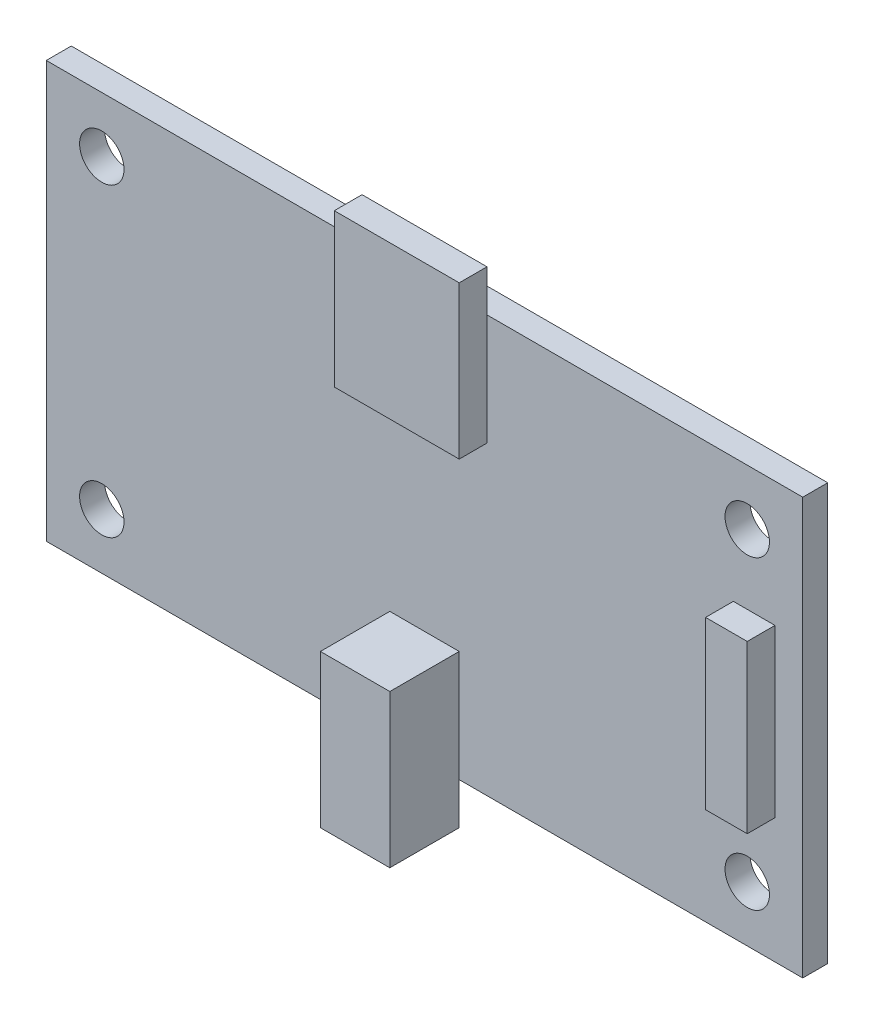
ISO-10303-21;
HEADER;
FILE_DESCRIPTION(('STEP AP214'),'2;1');
FILE_NAME('part.step','',(''),(''),'','','');
FILE_SCHEMA(('AUTOMOTIVE_DESIGN { 1 0 10303 214 1 1 1 1 }'));
ENDSEC;
DATA;
#1=APPLICATION_CONTEXT('core data for automotive mechanical design processes');
#2=APPLICATION_PROTOCOL_DEFINITION('international standard','automotive_design',2000,#1);
#3=PRODUCT_CONTEXT('',#1,'mechanical');
#4=PRODUCT('Part','Part','',(#3));
#5=PRODUCT_RELATED_PRODUCT_CATEGORY('part','',(#4));
#6=PRODUCT_DEFINITION_FORMATION('','',#4);
#7=PRODUCT_DEFINITION_CONTEXT('part definition',#1,'design');
#8=PRODUCT_DEFINITION('design','',#6,#7);
#9=PRODUCT_DEFINITION_SHAPE('','',#8);
#10=(LENGTH_UNIT() NAMED_UNIT(*) SI_UNIT(.MILLI.,.METRE.));
#11=(NAMED_UNIT(*) PLANE_ANGLE_UNIT() SI_UNIT($,.RADIAN.));
#12=(NAMED_UNIT(*) SI_UNIT($,.STERADIAN.) SOLID_ANGLE_UNIT());
#13=UNCERTAINTY_MEASURE_WITH_UNIT(LENGTH_MEASURE(1.E-05),#10,'distance_accuracy_value','');
#14=(GEOMETRIC_REPRESENTATION_CONTEXT(3) GLOBAL_UNCERTAINTY_ASSIGNED_CONTEXT((#13)) GLOBAL_UNIT_ASSIGNED_CONTEXT((#10,
#11,#12)) REPRESENTATION_CONTEXT('',''));
#15=CARTESIAN_POINT('',(0.,0.,0.));
#16=DIRECTION('',(0.,0.,1.));
#17=DIRECTION('',(1.,0.,0.));
#18=AXIS2_PLACEMENT_3D('',#15,#16,#17);
#19=CARTESIAN_POINT('',(0.,30.,1.8));
#20=DIRECTION('',(0.,0.,-1.));
#21=DIRECTION('',(-1.,0.,0.));
#22=AXIS2_PLACEMENT_3D('',#19,#20,#21);
#23=PLANE('',#22);
#24=CARTESIAN_POINT('',(4.,26.,1.8));
#25=DIRECTION('',(0.,0.,1.));
#26=DIRECTION('',(1.,0.,0.));
#27=AXIS2_PLACEMENT_3D('',#24,#25,#26);
#28=CIRCLE('',#27,1.6);
#29=CARTESIAN_POINT('',(5.6,26.,1.8));
#30=VERTEX_POINT('',#29);
#31=EDGE_CURVE('E576',#30,#30,#28,.T.);
#32=ORIENTED_EDGE('',*,*,#31,.F.);
#33=EDGE_LOOP('',(#32));
#34=FACE_BOUND('',#33,.T.);
#35=CARTESIAN_POINT('',(4.,4.,1.8));
#36=DIRECTION('',(0.,0.,1.));
#37=DIRECTION('',(1.,0.,0.));
#38=AXIS2_PLACEMENT_3D('',#35,#36,#37);
#39=CIRCLE('',#38,1.6);
#40=CARTESIAN_POINT('',(5.6,4.,1.8));
#41=VERTEX_POINT('',#40);
#42=EDGE_CURVE('E580',#41,#41,#39,.T.);
#43=ORIENTED_EDGE('',*,*,#42,.F.);
#44=EDGE_LOOP('',(#43));
#45=FACE_BOUND('',#44,.T.);
#46=CARTESIAN_POINT('',(50.5,4.,1.8));
#47=DIRECTION('',(0.,0.,1.));
#48=DIRECTION('',(1.,0.,0.));
#49=AXIS2_PLACEMENT_3D('',#46,#47,#48);
#50=CIRCLE('',#49,1.6);
#51=CARTESIAN_POINT('',(52.1,4.,1.8));
#52=VERTEX_POINT('',#51);
#53=EDGE_CURVE('E587',#52,#52,#50,.T.);
#54=ORIENTED_EDGE('',*,*,#53,.F.);
#55=EDGE_LOOP('',(#54));
#56=FACE_BOUND('',#55,.T.);
#57=CARTESIAN_POINT('',(50.5,26.,1.8));
#58=DIRECTION('',(0.,0.,1.));
#59=DIRECTION('',(1.,0.,0.));
#60=AXIS2_PLACEMENT_3D('',#57,#58,#59);
#61=CIRCLE('',#60,1.6);
#62=CARTESIAN_POINT('',(52.1,26.,1.8));
#63=VERTEX_POINT('',#62);
#64=EDGE_CURVE('E593',#63,#63,#61,.T.);
#65=ORIENTED_EDGE('',*,*,#64,.F.);
#66=EDGE_LOOP('',(#65));
#67=FACE_BOUND('',#66,.T.);
#68=DIRECTION('',(0.,-1.,0.));
#69=VECTOR('',#68,1.);
#70=CARTESIAN_POINT('',(22.75,33.,1.8));
#71=LINE('',#70,#69);
#72=CARTESIAN_POINT('',(22.75,30.,1.8));
#73=VERTEX_POINT('',#72);
#74=CARTESIAN_POINT('',(22.75,22.,1.8));
#75=VERTEX_POINT('',#74);
#76=EDGE_CURVE('E182',#73,#75,#71,.T.);
#77=ORIENTED_EDGE('',*,*,#76,.F.);
#78=DIRECTION('',(-1.,0.,0.));
#79=VECTOR('',#78,1.);
#80=CARTESIAN_POINT('',(0.,30.,1.8));
#81=LINE('',#80,#79);
#82=CARTESIAN_POINT('',(0.,30.,1.8));
#83=VERTEX_POINT('',#82);
#84=EDGE_CURVE('E265',#73,#83,#81,.T.);
#85=ORIENTED_EDGE('',*,*,#84,.T.);
#86=DIRECTION('',(0.,-1.,0.));
#87=VECTOR('',#86,1.);
#88=CARTESIAN_POINT('',(0.,0.,1.8));
#89=LINE('',#88,#87);
#90=CARTESIAN_POINT('',(0.,0.,1.8));
#91=VERTEX_POINT('',#90);
#92=EDGE_CURVE('E254',#83,#91,#89,.T.);
#93=ORIENTED_EDGE('',*,*,#92,.T.);
#94=DIRECTION('',(1.,0.,0.));
#95=VECTOR('',#94,1.);
#96=CARTESIAN_POINT('',(0.,0.,1.8));
#97=LINE('',#96,#95);
#98=CARTESIAN_POINT('',(24.75,0.,1.8));
#99=VERTEX_POINT('',#98);
#100=EDGE_CURVE('E259',#91,#99,#97,.T.);
#101=ORIENTED_EDGE('',*,*,#100,.T.);
#102=DIRECTION('',(0.,-1.,0.));
#103=VECTOR('',#102,1.);
#104=CARTESIAN_POINT('',(24.75,8.,1.8));
#105=LINE('',#104,#103);
#106=CARTESIAN_POINT('',(24.75,8.,1.8));
#107=VERTEX_POINT('',#106);
#108=EDGE_CURVE('E234',#107,#99,#105,.T.);
#109=ORIENTED_EDGE('',*,*,#108,.F.);
#110=DIRECTION('',(-1.,0.,0.));
#111=VECTOR('',#110,1.);
#112=CARTESIAN_POINT('',(24.75,8.,1.8));
#113=LINE('',#112,#111);
#114=CARTESIAN_POINT('',(29.75,8.,1.8));
#115=VERTEX_POINT('',#114);
#116=EDGE_CURVE('E227',#115,#107,#113,.T.);
#117=ORIENTED_EDGE('',*,*,#116,.F.);
#118=DIRECTION('',(0.,1.,0.));
#119=VECTOR('',#118,1.);
#120=CARTESIAN_POINT('',(29.75,8.,1.8));
#121=LINE('',#120,#119);
#122=CARTESIAN_POINT('',(29.75,0.,1.8));
#123=VERTEX_POINT('',#122);
#124=EDGE_CURVE('E11',#123,#115,#121,.T.);
#125=ORIENTED_EDGE('',*,*,#124,.F.);
#126=CARTESIAN_POINT('',(54.5,0.,1.8));
#127=VERTEX_POINT('',#126);
#128=EDGE_CURVE('E257',#123,#127,#97,.T.);
#129=ORIENTED_EDGE('',*,*,#128,.T.);
#130=DIRECTION('',(0.,1.,0.));
#131=VECTOR('',#130,1.);
#132=CARTESIAN_POINT('',(54.5,0.,1.8));
#133=LINE('',#132,#131);
#134=CARTESIAN_POINT('',(54.5,30.,1.8));
#135=VERTEX_POINT('',#134);
#136=EDGE_CURVE('E262',#127,#135,#133,.T.);
#137=ORIENTED_EDGE('',*,*,#136,.T.);
#138=CARTESIAN_POINT('',(31.75,30.,1.8));
#139=VERTEX_POINT('',#138);
#140=EDGE_CURVE('E266',#135,#139,#81,.T.);
#141=ORIENTED_EDGE('',*,*,#140,.T.);
#142=DIRECTION('',(0.,1.,0.));
#143=VECTOR('',#142,1.);
#144=CARTESIAN_POINT('',(31.75,33.,1.8));
#145=LINE('',#144,#143);
#146=CARTESIAN_POINT('',(31.75,22.,1.8));
#147=VERTEX_POINT('',#146);
#148=EDGE_CURVE('E207',#147,#139,#145,.T.);
#149=ORIENTED_EDGE('',*,*,#148,.F.);
#150=DIRECTION('',(1.,0.,0.));
#151=VECTOR('',#150,1.);
#152=CARTESIAN_POINT('',(22.75,22.,1.8));
#153=LINE('',#152,#151);
#154=EDGE_CURVE('E203',#75,#147,#153,.T.);
#155=ORIENTED_EDGE('',*,*,#154,.F.);
#156=EDGE_LOOP('',(#77,#85,#93,#101,#109,#117,#125,#129,#137,#141,#149,#155));
#157=FACE_BOUND('',#156,.T.);
#158=DIRECTION('',(0.,-1.,0.));
#159=VECTOR('',#158,1.);
#160=CARTESIAN_POINT('',(49.5,21.,1.8));
#161=LINE('',#160,#159);
#162=CARTESIAN_POINT('',(49.5,21.,1.8));
#163=VERTEX_POINT('',#162);
#164=CARTESIAN_POINT('',(49.5,9.,1.8));
#165=VERTEX_POINT('',#164);
#166=EDGE_CURVE('E181',#163,#165,#161,.T.);
#167=ORIENTED_EDGE('',*,*,#166,.F.);
#168=DIRECTION('',(-1.,0.,0.));
#169=VECTOR('',#168,1.);
#170=CARTESIAN_POINT('',(49.5,21.,1.8));
#171=LINE('',#170,#169);
#172=CARTESIAN_POINT('',(52.5,21.,1.8));
#173=VERTEX_POINT('',#172);
#174=EDGE_CURVE('E178',#173,#163,#171,.T.);
#175=ORIENTED_EDGE('',*,*,#174,.F.);
#176=DIRECTION('',(0.,1.,0.));
#177=VECTOR('',#176,1.);
#178=CARTESIAN_POINT('',(52.5,21.,1.8));
#179=LINE('',#178,#177);
#180=CARTESIAN_POINT('',(52.5,9.,1.8));
#181=VERTEX_POINT('',#180);
#182=EDGE_CURVE('E56',#181,#173,#179,.T.);
#183=ORIENTED_EDGE('',*,*,#182,.F.);
#184=DIRECTION('',(1.,0.,0.));
#185=VECTOR('',#184,1.);
#186=CARTESIAN_POINT('',(49.5,9.,1.8));
#187=LINE('',#186,#185);
#188=EDGE_CURVE('E51',#165,#181,#187,.T.);
#189=ORIENTED_EDGE('',*,*,#188,.F.);
#190=EDGE_LOOP('',(#167,#175,#183,#189));
#191=FACE_BOUND('',#190,.T.);
#192=ADVANCED_FACE('F34',(#34,#45,#56,#67,#157,#191),#23,.F.);
#193=CARTESIAN_POINT('',(0.,0.,1.8));
#194=DIRECTION('',(1.,0.,0.));
#195=DIRECTION('',(0.,0.,-1.));
#196=AXIS2_PLACEMENT_3D('',#193,#194,#195);
#197=PLANE('',#196);
#198=DIRECTION('',(0.,-1.,0.));
#199=VECTOR('',#198,1.);
#200=CARTESIAN_POINT('',(0.,0.,0.));
#201=LINE('',#200,#199);
#202=CARTESIAN_POINT('',(0.,30.,0.));
#203=VERTEX_POINT('',#202);
#204=CARTESIAN_POINT('',(0.,0.,0.));
#205=VERTEX_POINT('',#204);
#206=EDGE_CURVE('E253',#203,#205,#201,.T.);
#207=ORIENTED_EDGE('',*,*,#206,.T.);
#208=DIRECTION('',(0.,0.,-1.));
#209=VECTOR('',#208,1.);
#210=CARTESIAN_POINT('',(0.,0.,1.8));
#211=LINE('',#210,#209);
#212=EDGE_CURVE('E38',#91,#205,#211,.T.);
#213=ORIENTED_EDGE('',*,*,#212,.F.);
#214=ORIENTED_EDGE('',*,*,#92,.F.);
#215=DIRECTION('',(0.,0.,-1.));
#216=VECTOR('',#215,1.);
#217=CARTESIAN_POINT('',(0.,30.,1.8));
#218=LINE('',#217,#216);
#219=EDGE_CURVE('E269',#83,#203,#218,.T.);
#220=ORIENTED_EDGE('',*,*,#219,.T.);
#221=EDGE_LOOP('',(#207,#213,#214,#220));
#222=FACE_BOUND('',#221,.T.);
#223=ADVANCED_FACE('F36',(#222),#197,.F.);
#224=CARTESIAN_POINT('',(0.,0.,1.8));
#225=DIRECTION('',(0.,1.,0.));
#226=DIRECTION('',(0.,0.,1.));
#227=AXIS2_PLACEMENT_3D('',#224,#225,#226);
#228=PLANE('',#227);
#229=DIRECTION('',(1.,0.,0.));
#230=VECTOR('',#229,1.);
#231=CARTESIAN_POINT('',(0.,0.,0.));
#232=LINE('',#231,#230);
#233=CARTESIAN_POINT('',(54.5,0.,0.));
#234=VERTEX_POINT('',#233);
#235=EDGE_CURVE('E273',#205,#234,#232,.T.);
#236=ORIENTED_EDGE('',*,*,#235,.T.);
#237=DIRECTION('',(0.,0.,-1.));
#238=VECTOR('',#237,1.);
#239=CARTESIAN_POINT('',(54.5,0.,1.8));
#240=LINE('',#239,#238);
#241=EDGE_CURVE('E282',#127,#234,#240,.T.);
#242=ORIENTED_EDGE('',*,*,#241,.F.);
#243=ORIENTED_EDGE('',*,*,#128,.F.);
#244=EDGE_CURVE('E263',#99,#123,#97,.T.);
#245=ORIENTED_EDGE('',*,*,#244,.F.);
#246=ORIENTED_EDGE('',*,*,#100,.F.);
#247=ORIENTED_EDGE('',*,*,#212,.T.);
#248=EDGE_LOOP('',(#236,#242,#243,#245,#246,#247));
#249=FACE_BOUND('',#248,.T.);
#250=ADVANCED_FACE('F291',(#249),#228,.F.);
#251=CARTESIAN_POINT('',(54.5,0.,1.8));
#252=DIRECTION('',(-1.,0.,0.));
#253=DIRECTION('',(0.,-1.,0.));
#254=AXIS2_PLACEMENT_3D('',#251,#252,#253);
#255=PLANE('',#254);
#256=DIRECTION('',(0.,1.,0.));
#257=VECTOR('',#256,1.);
#258=CARTESIAN_POINT('',(54.5,0.,0.));
#259=LINE('',#258,#257);
#260=CARTESIAN_POINT('',(54.5,30.,0.));
#261=VERTEX_POINT('',#260);
#262=EDGE_CURVE('E275',#234,#261,#259,.T.);
#263=ORIENTED_EDGE('',*,*,#262,.T.);
#264=DIRECTION('',(0.,0.,-1.));
#265=VECTOR('',#264,1.);
#266=CARTESIAN_POINT('',(54.5,30.,1.8));
#267=LINE('',#266,#265);
#268=EDGE_CURVE('E280',#135,#261,#267,.T.);
#269=ORIENTED_EDGE('',*,*,#268,.F.);
#270=ORIENTED_EDGE('',*,*,#136,.F.);
#271=ORIENTED_EDGE('',*,*,#241,.T.);
#272=EDGE_LOOP('',(#263,#269,#270,#271));
#273=FACE_BOUND('',#272,.T.);
#274=ADVANCED_FACE('F300',(#273),#255,.F.);
#275=CARTESIAN_POINT('',(0.,30.,1.8));
#276=DIRECTION('',(0.,-1.,0.));
#277=DIRECTION('',(0.,0.,-1.));
#278=AXIS2_PLACEMENT_3D('',#275,#276,#277);
#279=PLANE('',#278);
#280=DIRECTION('',(-1.,0.,0.));
#281=VECTOR('',#280,1.);
#282=CARTESIAN_POINT('',(0.,30.,0.));
#283=LINE('',#282,#281);
#284=EDGE_CURVE('E258',#261,#203,#283,.T.);
#285=ORIENTED_EDGE('',*,*,#284,.T.);
#286=ORIENTED_EDGE('',*,*,#219,.F.);
#287=ORIENTED_EDGE('',*,*,#84,.F.);
#288=EDGE_CURVE('E270',#139,#73,#81,.T.);
#289=ORIENTED_EDGE('',*,*,#288,.F.);
#290=ORIENTED_EDGE('',*,*,#140,.F.);
#291=ORIENTED_EDGE('',*,*,#268,.T.);
#292=EDGE_LOOP('',(#285,#286,#287,#289,#290,#291));
#293=FACE_BOUND('',#292,.T.);
#294=ADVANCED_FACE('F303',(#293),#279,.F.);
#295=CARTESIAN_POINT('',(0.,30.,0.));
#296=DIRECTION('',(0.,0.,-1.));
#297=DIRECTION('',(-1.,0.,0.));
#298=AXIS2_PLACEMENT_3D('',#295,#296,#297);
#299=PLANE('',#298);
#300=CARTESIAN_POINT('',(4.,26.,0.));
#301=DIRECTION('',(0.,0.,-1.));
#302=DIRECTION('',(-1.,0.,0.));
#303=AXIS2_PLACEMENT_3D('',#300,#301,#302);
#304=CIRCLE('',#303,1.6);
#305=CARTESIAN_POINT('',(2.4,26.,0.));
#306=VERTEX_POINT('',#305);
#307=EDGE_CURVE('E574',#306,#306,#304,.F.);
#308=ORIENTED_EDGE('',*,*,#307,.T.);
#309=EDGE_LOOP('',(#308));
#310=FACE_BOUND('',#309,.T.);
#311=CARTESIAN_POINT('',(4.,4.,0.));
#312=DIRECTION('',(0.,0.,-1.));
#313=DIRECTION('',(-1.,0.,0.));
#314=AXIS2_PLACEMENT_3D('',#311,#312,#313);
#315=CIRCLE('',#314,1.6);
#316=CARTESIAN_POINT('',(2.4,4.,0.));
#317=VERTEX_POINT('',#316);
#318=EDGE_CURVE('E577',#317,#317,#315,.F.);
#319=ORIENTED_EDGE('',*,*,#318,.T.);
#320=EDGE_LOOP('',(#319));
#321=FACE_BOUND('',#320,.T.);
#322=CARTESIAN_POINT('',(50.5,4.,0.));
#323=DIRECTION('',(0.,0.,-1.));
#324=DIRECTION('',(-1.,0.,0.));
#325=AXIS2_PLACEMENT_3D('',#322,#323,#324);
#326=CIRCLE('',#325,1.6);
#327=CARTESIAN_POINT('',(48.9,4.,0.));
#328=VERTEX_POINT('',#327);
#329=EDGE_CURVE('E585',#328,#328,#326,.F.);
#330=ORIENTED_EDGE('',*,*,#329,.T.);
#331=EDGE_LOOP('',(#330));
#332=FACE_BOUND('',#331,.T.);
#333=CARTESIAN_POINT('',(50.5,26.,0.));
#334=DIRECTION('',(0.,0.,-1.));
#335=DIRECTION('',(-1.,0.,0.));
#336=AXIS2_PLACEMENT_3D('',#333,#334,#335);
#337=CIRCLE('',#336,1.6);
#338=CARTESIAN_POINT('',(48.9,26.,0.));
#339=VERTEX_POINT('',#338);
#340=EDGE_CURVE('E590',#339,#339,#337,.F.);
#341=ORIENTED_EDGE('',*,*,#340,.T.);
#342=EDGE_LOOP('',(#341));
#343=FACE_BOUND('',#342,.T.);
#344=ORIENTED_EDGE('',*,*,#206,.F.);
#345=ORIENTED_EDGE('',*,*,#284,.F.);
#346=ORIENTED_EDGE('',*,*,#262,.F.);
#347=ORIENTED_EDGE('',*,*,#235,.F.);
#348=EDGE_LOOP('',(#344,#345,#346,#347));
#349=FACE_BOUND('',#348,.T.);
#350=ADVANCED_FACE('F298',(#310,#321,#332,#343,#349),#299,.T.);
#351=CARTESIAN_POINT('',(24.75,-3.,1.8));
#352=DIRECTION('',(0.,0.,1.));
#353=DIRECTION('',(1.,0.,0.));
#354=AXIS2_PLACEMENT_3D('',#351,#352,#353);
#355=PLANE('',#354);
#356=CARTESIAN_POINT('',(24.75,-3.,1.8));
#357=VERTEX_POINT('',#356);
#358=EDGE_CURVE('E222',#99,#357,#105,.T.);
#359=ORIENTED_EDGE('',*,*,#358,.F.);
#360=ORIENTED_EDGE('',*,*,#244,.T.);
#361=CARTESIAN_POINT('',(29.75,-3.,1.8));
#362=VERTEX_POINT('',#361);
#363=EDGE_CURVE('E44',#362,#123,#121,.T.);
#364=ORIENTED_EDGE('',*,*,#363,.F.);
#365=DIRECTION('',(1.,0.,0.));
#366=VECTOR('',#365,1.);
#367=CARTESIAN_POINT('',(24.75,-3.,1.8));
#368=LINE('',#367,#366);
#369=EDGE_CURVE('E237',#357,#362,#368,.T.);
#370=ORIENTED_EDGE('',*,*,#369,.F.);
#371=EDGE_LOOP('',(#359,#360,#364,#370));
#372=FACE_BOUND('',#371,.T.);
#373=ADVANCED_FACE('F352',(#372),#355,.F.);
#374=CARTESIAN_POINT('',(24.75,8.,6.8));
#375=DIRECTION('',(1.,0.,0.));
#376=DIRECTION('',(0.,1.,0.));
#377=AXIS2_PLACEMENT_3D('',#374,#375,#376);
#378=PLANE('',#377);
#379=ORIENTED_EDGE('',*,*,#108,.T.);
#380=ORIENTED_EDGE('',*,*,#358,.T.);
#381=DIRECTION('',(0.,0.,-1.));
#382=VECTOR('',#381,1.);
#383=CARTESIAN_POINT('',(24.75,-3.,6.8));
#384=LINE('',#383,#382);
#385=CARTESIAN_POINT('',(24.75,-3.,6.8));
#386=VERTEX_POINT('',#385);
#387=EDGE_CURVE('E250',#386,#357,#384,.T.);
#388=ORIENTED_EDGE('',*,*,#387,.F.);
#389=DIRECTION('',(0.,-1.,0.));
#390=VECTOR('',#389,1.);
#391=CARTESIAN_POINT('',(24.75,8.,6.8));
#392=LINE('',#391,#390);
#393=CARTESIAN_POINT('',(24.75,8.,6.8));
#394=VERTEX_POINT('',#393);
#395=EDGE_CURVE('E223',#394,#386,#392,.T.);
#396=ORIENTED_EDGE('',*,*,#395,.F.);
#397=DIRECTION('',(0.,0.,-1.));
#398=VECTOR('',#397,1.);
#399=CARTESIAN_POINT('',(24.75,8.,6.8));
#400=LINE('',#399,#398);
#401=EDGE_CURVE('E233',#394,#107,#400,.T.);
#402=ORIENTED_EDGE('',*,*,#401,.T.);
#403=EDGE_LOOP('',(#379,#380,#388,#396,#402));
#404=FACE_BOUND('',#403,.T.);
#405=ADVANCED_FACE('F348',(#404),#378,.F.);
#406=CARTESIAN_POINT('',(24.75,-3.,6.8));
#407=DIRECTION('',(0.,1.,0.));
#408=DIRECTION('',(-1.,0.,0.));
#409=AXIS2_PLACEMENT_3D('',#406,#407,#408);
#410=PLANE('',#409);
#411=ORIENTED_EDGE('',*,*,#369,.T.);
#412=DIRECTION('',(0.,0.,-1.));
#413=VECTOR('',#412,1.);
#414=CARTESIAN_POINT('',(29.75,-3.,6.8));
#415=LINE('',#414,#413);
#416=CARTESIAN_POINT('',(29.75,-3.,6.8));
#417=VERTEX_POINT('',#416);
#418=EDGE_CURVE('E247',#417,#362,#415,.T.);
#419=ORIENTED_EDGE('',*,*,#418,.F.);
#420=DIRECTION('',(1.,0.,0.));
#421=VECTOR('',#420,1.);
#422=CARTESIAN_POINT('',(24.75,-3.,6.8));
#423=LINE('',#422,#421);
#424=EDGE_CURVE('E226',#386,#417,#423,.T.);
#425=ORIENTED_EDGE('',*,*,#424,.F.);
#426=ORIENTED_EDGE('',*,*,#387,.T.);
#427=EDGE_LOOP('',(#411,#419,#425,#426));
#428=FACE_BOUND('',#427,.T.);
#429=ADVANCED_FACE('F390',(#428),#410,.F.);
#430=CARTESIAN_POINT('',(29.75,8.,6.8));
#431=DIRECTION('',(-1.,0.,0.));
#432=DIRECTION('',(0.,-1.,0.));
#433=AXIS2_PLACEMENT_3D('',#430,#431,#432);
#434=PLANE('',#433);
#435=ORIENTED_EDGE('',*,*,#363,.T.);
#436=ORIENTED_EDGE('',*,*,#124,.T.);
#437=DIRECTION('',(0.,0.,-1.));
#438=VECTOR('',#437,1.);
#439=CARTESIAN_POINT('',(29.75,8.,6.8));
#440=LINE('',#439,#438);
#441=CARTESIAN_POINT('',(29.75,8.,6.8));
#442=VERTEX_POINT('',#441);
#443=EDGE_CURVE('E244',#442,#115,#440,.T.);
#444=ORIENTED_EDGE('',*,*,#443,.F.);
#445=DIRECTION('',(0.,1.,0.));
#446=VECTOR('',#445,1.);
#447=CARTESIAN_POINT('',(29.75,8.,6.8));
#448=LINE('',#447,#446);
#449=EDGE_CURVE('E229',#417,#442,#448,.T.);
#450=ORIENTED_EDGE('',*,*,#449,.F.);
#451=ORIENTED_EDGE('',*,*,#418,.T.);
#452=EDGE_LOOP('',(#435,#436,#444,#450,#451));
#453=FACE_BOUND('',#452,.T.);
#454=ADVANCED_FACE('F397',(#453),#434,.F.);
#455=CARTESIAN_POINT('',(24.75,8.,6.8));
#456=DIRECTION('',(0.,-1.,0.));
#457=DIRECTION('',(0.,0.,-1.));
#458=AXIS2_PLACEMENT_3D('',#455,#456,#457);
#459=PLANE('',#458);
#460=ORIENTED_EDGE('',*,*,#116,.T.);
#461=ORIENTED_EDGE('',*,*,#401,.F.);
#462=DIRECTION('',(-1.,0.,0.));
#463=VECTOR('',#462,1.);
#464=CARTESIAN_POINT('',(24.75,8.,6.8));
#465=LINE('',#464,#463);
#466=EDGE_CURVE('E231',#442,#394,#465,.T.);
#467=ORIENTED_EDGE('',*,*,#466,.F.);
#468=ORIENTED_EDGE('',*,*,#443,.T.);
#469=EDGE_LOOP('',(#460,#461,#467,#468));
#470=FACE_BOUND('',#469,.T.);
#471=ADVANCED_FACE('F404',(#470),#459,.F.);
#472=CARTESIAN_POINT('',(24.75,-3.,6.8));
#473=DIRECTION('',(0.,0.,1.));
#474=DIRECTION('',(1.,0.,0.));
#475=AXIS2_PLACEMENT_3D('',#472,#473,#474);
#476=PLANE('',#475);
#477=ORIENTED_EDGE('',*,*,#395,.T.);
#478=ORIENTED_EDGE('',*,*,#424,.T.);
#479=ORIENTED_EDGE('',*,*,#449,.T.);
#480=ORIENTED_EDGE('',*,*,#466,.T.);
#481=EDGE_LOOP('',(#477,#478,#479,#480));
#482=FACE_BOUND('',#481,.T.);
#483=ADVANCED_FACE('F412',(#482),#476,.T.);
#484=CARTESIAN_POINT('',(22.75,22.,1.8));
#485=DIRECTION('',(0.,0.,1.));
#486=DIRECTION('',(1.,0.,0.));
#487=AXIS2_PLACEMENT_3D('',#484,#485,#486);
#488=PLANE('',#487);
#489=CARTESIAN_POINT('',(31.75,33.,1.8));
#490=VERTEX_POINT('',#489);
#491=EDGE_CURVE('E206',#139,#490,#145,.T.);
#492=ORIENTED_EDGE('',*,*,#491,.F.);
#493=ORIENTED_EDGE('',*,*,#288,.T.);
#494=CARTESIAN_POINT('',(22.75,33.,1.8));
#495=VERTEX_POINT('',#494);
#496=EDGE_CURVE('E185',#495,#73,#71,.T.);
#497=ORIENTED_EDGE('',*,*,#496,.F.);
#498=DIRECTION('',(-1.,0.,0.));
#499=VECTOR('',#498,1.);
#500=CARTESIAN_POINT('',(22.75,33.,1.8));
#501=LINE('',#500,#499);
#502=EDGE_CURVE('E195',#490,#495,#501,.T.);
#503=ORIENTED_EDGE('',*,*,#502,.F.);
#504=EDGE_LOOP('',(#492,#493,#497,#503));
#505=FACE_BOUND('',#504,.T.);
#506=ADVANCED_FACE('F310',(#505),#488,.F.);
#507=CARTESIAN_POINT('',(22.75,33.,3.8));
#508=DIRECTION('',(1.,0.,0.));
#509=DIRECTION('',(0.,1.,0.));
#510=AXIS2_PLACEMENT_3D('',#507,#508,#509);
#511=PLANE('',#510);
#512=ORIENTED_EDGE('',*,*,#496,.T.);
#513=ORIENTED_EDGE('',*,*,#76,.T.);
#514=DIRECTION('',(0.,0.,-1.));
#515=VECTOR('',#514,1.);
#516=CARTESIAN_POINT('',(22.75,22.,3.8));
#517=LINE('',#516,#515);
#518=CARTESIAN_POINT('',(22.75,22.,3.8));
#519=VERTEX_POINT('',#518);
#520=EDGE_CURVE('E219',#519,#75,#517,.T.);
#521=ORIENTED_EDGE('',*,*,#520,.F.);
#522=DIRECTION('',(0.,-1.,0.));
#523=VECTOR('',#522,1.);
#524=CARTESIAN_POINT('',(22.75,33.,3.8));
#525=LINE('',#524,#523);
#526=CARTESIAN_POINT('',(22.75,33.,3.8));
#527=VERTEX_POINT('',#526);
#528=EDGE_CURVE('E191',#527,#519,#525,.T.);
#529=ORIENTED_EDGE('',*,*,#528,.F.);
#530=DIRECTION('',(0.,0.,-1.));
#531=VECTOR('',#530,1.);
#532=CARTESIAN_POINT('',(22.75,33.,3.8));
#533=LINE('',#532,#531);
#534=EDGE_CURVE('E200',#527,#495,#533,.T.);
#535=ORIENTED_EDGE('',*,*,#534,.T.);
#536=EDGE_LOOP('',(#512,#513,#521,#529,#535));
#537=FACE_BOUND('',#536,.T.);
#538=ADVANCED_FACE('F321',(#537),#511,.F.);
#539=CARTESIAN_POINT('',(22.75,22.,3.8));
#540=DIRECTION('',(0.,1.,0.));
#541=DIRECTION('',(-1.,0.,0.));
#542=AXIS2_PLACEMENT_3D('',#539,#540,#541);
#543=PLANE('',#542);
#544=ORIENTED_EDGE('',*,*,#154,.T.);
#545=DIRECTION('',(0.,0.,-1.));
#546=VECTOR('',#545,1.);
#547=CARTESIAN_POINT('',(31.75,22.,3.8));
#548=LINE('',#547,#546);
#549=CARTESIAN_POINT('',(31.75,22.,3.8));
#550=VERTEX_POINT('',#549);
#551=EDGE_CURVE('E216',#550,#147,#548,.T.);
#552=ORIENTED_EDGE('',*,*,#551,.F.);
#553=DIRECTION('',(1.,0.,0.));
#554=VECTOR('',#553,1.);
#555=CARTESIAN_POINT('',(22.75,22.,3.8));
#556=LINE('',#555,#554);
#557=EDGE_CURVE('E194',#519,#550,#556,.T.);
#558=ORIENTED_EDGE('',*,*,#557,.F.);
#559=ORIENTED_EDGE('',*,*,#520,.T.);
#560=EDGE_LOOP('',(#544,#552,#558,#559));
#561=FACE_BOUND('',#560,.T.);
#562=ADVANCED_FACE('F318',(#561),#543,.F.);
#563=CARTESIAN_POINT('',(31.75,33.,3.8));
#564=DIRECTION('',(-1.,0.,0.));
#565=DIRECTION('',(0.,-1.,0.));
#566=AXIS2_PLACEMENT_3D('',#563,#564,#565);
#567=PLANE('',#566);
#568=ORIENTED_EDGE('',*,*,#148,.T.);
#569=ORIENTED_EDGE('',*,*,#491,.T.);
#570=DIRECTION('',(0.,0.,-1.));
#571=VECTOR('',#570,1.);
#572=CARTESIAN_POINT('',(31.75,33.,3.8));
#573=LINE('',#572,#571);
#574=CARTESIAN_POINT('',(31.75,33.,3.8));
#575=VERTEX_POINT('',#574);
#576=EDGE_CURVE('E213',#575,#490,#573,.T.);
#577=ORIENTED_EDGE('',*,*,#576,.F.);
#578=DIRECTION('',(0.,1.,0.));
#579=VECTOR('',#578,1.);
#580=CARTESIAN_POINT('',(31.75,33.,3.8));
#581=LINE('',#580,#579);
#582=EDGE_CURVE('E197',#550,#575,#581,.T.);
#583=ORIENTED_EDGE('',*,*,#582,.F.);
#584=ORIENTED_EDGE('',*,*,#551,.T.);
#585=EDGE_LOOP('',(#568,#569,#577,#583,#584));
#586=FACE_BOUND('',#585,.T.);
#587=ADVANCED_FACE('F314',(#586),#567,.F.);
#588=CARTESIAN_POINT('',(22.75,33.,3.8));
#589=DIRECTION('',(0.,-1.,0.));
#590=DIRECTION('',(0.,0.,-1.));
#591=AXIS2_PLACEMENT_3D('',#588,#589,#590);
#592=PLANE('',#591);
#593=ORIENTED_EDGE('',*,*,#502,.T.);
#594=ORIENTED_EDGE('',*,*,#534,.F.);
#595=DIRECTION('',(-1.,0.,0.));
#596=VECTOR('',#595,1.);
#597=CARTESIAN_POINT('',(22.75,33.,3.8));
#598=LINE('',#597,#596);
#599=EDGE_CURVE('E199',#575,#527,#598,.T.);
#600=ORIENTED_EDGE('',*,*,#599,.F.);
#601=ORIENTED_EDGE('',*,*,#576,.T.);
#602=EDGE_LOOP('',(#593,#594,#600,#601));
#603=FACE_BOUND('',#602,.T.);
#604=ADVANCED_FACE('F326',(#603),#592,.F.);
#605=CARTESIAN_POINT('',(22.75,22.,3.8));
#606=DIRECTION('',(0.,0.,1.));
#607=DIRECTION('',(1.,0.,0.));
#608=AXIS2_PLACEMENT_3D('',#605,#606,#607);
#609=PLANE('',#608);
#610=ORIENTED_EDGE('',*,*,#528,.T.);
#611=ORIENTED_EDGE('',*,*,#557,.T.);
#612=ORIENTED_EDGE('',*,*,#582,.T.);
#613=ORIENTED_EDGE('',*,*,#599,.T.);
#614=EDGE_LOOP('',(#610,#611,#612,#613));
#615=FACE_BOUND('',#614,.T.);
#616=ADVANCED_FACE('F328',(#615),#609,.T.);
#617=CARTESIAN_POINT('',(49.5,21.,3.8));
#618=DIRECTION('',(1.,0.,0.));
#619=DIRECTION('',(0.,0.,-1.));
#620=AXIS2_PLACEMENT_3D('',#617,#618,#619);
#621=PLANE('',#620);
#622=ORIENTED_EDGE('',*,*,#166,.T.);
#623=DIRECTION('',(0.,0.,-1.));
#624=VECTOR('',#623,1.);
#625=CARTESIAN_POINT('',(49.5,9.,3.8));
#626=LINE('',#625,#624);
#627=CARTESIAN_POINT('',(49.5,9.,3.8));
#628=VERTEX_POINT('',#627);
#629=EDGE_CURVE('E162',#628,#165,#626,.T.);
#630=ORIENTED_EDGE('',*,*,#629,.F.);
#631=DIRECTION('',(0.,-1.,0.));
#632=VECTOR('',#631,1.);
#633=CARTESIAN_POINT('',(49.5,21.,3.8));
#634=LINE('',#633,#632);
#635=CARTESIAN_POINT('',(49.5,21.,3.8));
#636=VERTEX_POINT('',#635);
#637=EDGE_CURVE('E169',#636,#628,#634,.T.);
#638=ORIENTED_EDGE('',*,*,#637,.F.);
#639=DIRECTION('',(0.,0.,-1.));
#640=VECTOR('',#639,1.);
#641=CARTESIAN_POINT('',(49.5,21.,3.8));
#642=LINE('',#641,#640);
#643=EDGE_CURVE('E600',#636,#163,#642,.T.);
#644=ORIENTED_EDGE('',*,*,#643,.T.);
#645=EDGE_LOOP('',(#622,#630,#638,#644));
#646=FACE_BOUND('',#645,.T.);
#647=ADVANCED_FACE('F180',(#646),#621,.F.);
#648=CARTESIAN_POINT('',(49.5,9.,3.8));
#649=DIRECTION('',(0.,1.,0.));
#650=DIRECTION('',(-1.,0.,0.));
#651=AXIS2_PLACEMENT_3D('',#648,#649,#650);
#652=PLANE('',#651);
#653=ORIENTED_EDGE('',*,*,#188,.T.);
#654=DIRECTION('',(0.,0.,-1.));
#655=VECTOR('',#654,1.);
#656=CARTESIAN_POINT('',(52.5,9.,3.8));
#657=LINE('',#656,#655);
#658=CARTESIAN_POINT('',(52.5,9.,3.8));
#659=VERTEX_POINT('',#658);
#660=EDGE_CURVE('E165',#659,#181,#657,.T.);
#661=ORIENTED_EDGE('',*,*,#660,.F.);
#662=DIRECTION('',(1.,0.,0.));
#663=VECTOR('',#662,1.);
#664=CARTESIAN_POINT('',(49.5,9.,3.8));
#665=LINE('',#664,#663);
#666=EDGE_CURVE('E158',#628,#659,#665,.T.);
#667=ORIENTED_EDGE('',*,*,#666,.F.);
#668=ORIENTED_EDGE('',*,*,#629,.T.);
#669=EDGE_LOOP('',(#653,#661,#667,#668));
#670=FACE_BOUND('',#669,.T.);
#671=ADVANCED_FACE('F160',(#670),#652,.F.);
#672=CARTESIAN_POINT('',(52.5,21.,3.8));
#673=DIRECTION('',(-1.,0.,0.));
#674=DIRECTION('',(0.,0.,1.));
#675=AXIS2_PLACEMENT_3D('',#672,#673,#674);
#676=PLANE('',#675);
#677=ORIENTED_EDGE('',*,*,#182,.T.);
#678=DIRECTION('',(0.,0.,-1.));
#679=VECTOR('',#678,1.);
#680=CARTESIAN_POINT('',(52.5,21.,3.8));
#681=LINE('',#680,#679);
#682=CARTESIAN_POINT('',(52.5,21.,3.8));
#683=VERTEX_POINT('',#682);
#684=EDGE_CURVE('E187',#683,#173,#681,.T.);
#685=ORIENTED_EDGE('',*,*,#684,.F.);
#686=DIRECTION('',(0.,1.,0.));
#687=VECTOR('',#686,1.);
#688=CARTESIAN_POINT('',(52.5,21.,3.8));
#689=LINE('',#688,#687);
#690=EDGE_CURVE('E168',#659,#683,#689,.T.);
#691=ORIENTED_EDGE('',*,*,#690,.F.);
#692=ORIENTED_EDGE('',*,*,#660,.T.);
#693=EDGE_LOOP('',(#677,#685,#691,#692));
#694=FACE_BOUND('',#693,.T.);
#695=ADVANCED_FACE('F465',(#694),#676,.F.);
#696=CARTESIAN_POINT('',(49.5,21.,3.8));
#697=DIRECTION('',(0.,-1.,0.));
#698=DIRECTION('',(0.,0.,-1.));
#699=AXIS2_PLACEMENT_3D('',#696,#697,#698);
#700=PLANE('',#699);
#701=ORIENTED_EDGE('',*,*,#174,.T.);
#702=ORIENTED_EDGE('',*,*,#643,.F.);
#703=DIRECTION('',(-1.,0.,0.));
#704=VECTOR('',#703,1.);
#705=CARTESIAN_POINT('',(49.5,21.,3.8));
#706=LINE('',#705,#704);
#707=EDGE_CURVE('E174',#683,#636,#706,.T.);
#708=ORIENTED_EDGE('',*,*,#707,.F.);
#709=ORIENTED_EDGE('',*,*,#684,.T.);
#710=EDGE_LOOP('',(#701,#702,#708,#709));
#711=FACE_BOUND('',#710,.T.);
#712=ADVANCED_FACE('F474',(#711),#700,.F.);
#713=CARTESIAN_POINT('',(49.5,9.,3.8));
#714=DIRECTION('',(0.,0.,1.));
#715=DIRECTION('',(1.,0.,0.));
#716=AXIS2_PLACEMENT_3D('',#713,#714,#715);
#717=PLANE('',#716);
#718=ORIENTED_EDGE('',*,*,#637,.T.);
#719=ORIENTED_EDGE('',*,*,#666,.T.);
#720=ORIENTED_EDGE('',*,*,#690,.T.);
#721=ORIENTED_EDGE('',*,*,#707,.T.);
#722=EDGE_LOOP('',(#718,#719,#720,#721));
#723=FACE_BOUND('',#722,.T.);
#724=ADVANCED_FACE('F172',(#723),#717,.T.);
#725=CARTESIAN_POINT('',(50.5,26.,-0.000999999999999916));
#726=DIRECTION('',(0.,0.,1.));
#727=DIRECTION('',(1.,0.,0.));
#728=AXIS2_PLACEMENT_3D('',#725,#726,#727);
#729=CYLINDRICAL_SURFACE('',#728,1.6);
#730=ORIENTED_EDGE('',*,*,#340,.F.);
#731=EDGE_LOOP('',(#730));
#732=FACE_BOUND('',#731,.T.);
#733=ORIENTED_EDGE('',*,*,#64,.T.);
#734=EDGE_LOOP('',(#733));
#735=FACE_BOUND('',#734,.T.);
#736=ADVANCED_FACE('F492',(#732,#735),#729,.F.);
#737=CARTESIAN_POINT('',(50.5,4.,-0.000999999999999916));
#738=DIRECTION('',(0.,0.,1.));
#739=DIRECTION('',(1.,0.,0.));
#740=AXIS2_PLACEMENT_3D('',#737,#738,#739);
#741=CYLINDRICAL_SURFACE('',#740,1.6);
#742=ORIENTED_EDGE('',*,*,#329,.F.);
#743=EDGE_LOOP('',(#742));
#744=FACE_BOUND('',#743,.T.);
#745=ORIENTED_EDGE('',*,*,#53,.T.);
#746=EDGE_LOOP('',(#745));
#747=FACE_BOUND('',#746,.T.);
#748=ADVANCED_FACE('F537',(#744,#747),#741,.F.);
#749=CARTESIAN_POINT('',(4.,4.,-0.000999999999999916));
#750=DIRECTION('',(0.,0.,1.));
#751=DIRECTION('',(1.,0.,0.));
#752=AXIS2_PLACEMENT_3D('',#749,#750,#751);
#753=CYLINDRICAL_SURFACE('',#752,1.6);
#754=ORIENTED_EDGE('',*,*,#318,.F.);
#755=EDGE_LOOP('',(#754));
#756=FACE_BOUND('',#755,.T.);
#757=ORIENTED_EDGE('',*,*,#42,.T.);
#758=EDGE_LOOP('',(#757));
#759=FACE_BOUND('',#758,.T.);
#760=ADVANCED_FACE('F544',(#756,#759),#753,.F.);
#761=CARTESIAN_POINT('',(4.,26.,-0.000999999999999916));
#762=DIRECTION('',(0.,0.,1.));
#763=DIRECTION('',(1.,0.,0.));
#764=AXIS2_PLACEMENT_3D('',#761,#762,#763);
#765=CYLINDRICAL_SURFACE('',#764,1.6);
#766=ORIENTED_EDGE('',*,*,#307,.F.);
#767=EDGE_LOOP('',(#766));
#768=FACE_BOUND('',#767,.T.);
#769=ORIENTED_EDGE('',*,*,#31,.T.);
#770=EDGE_LOOP('',(#769));
#771=FACE_BOUND('',#770,.T.);
#772=ADVANCED_FACE('F552',(#768,#771),#765,.F.);
#773=CLOSED_SHELL('',(#192,#223,#250,#274,#294,#350,#373,#405,#429,#454,#471,#483,#506,#538,
#562,#587,#604,#616,#647,#671,#695,#712,#724,#736,#748,#760,#772));
#774=MANIFOLD_SOLID_BREP('B2',#773);
#775=ADVANCED_BREP_SHAPE_REPRESENTATION('',(#18,#774),#14);
#776=SHAPE_DEFINITION_REPRESENTATION(#9,#775);
ENDSEC;
END-ISO-10303-21;
